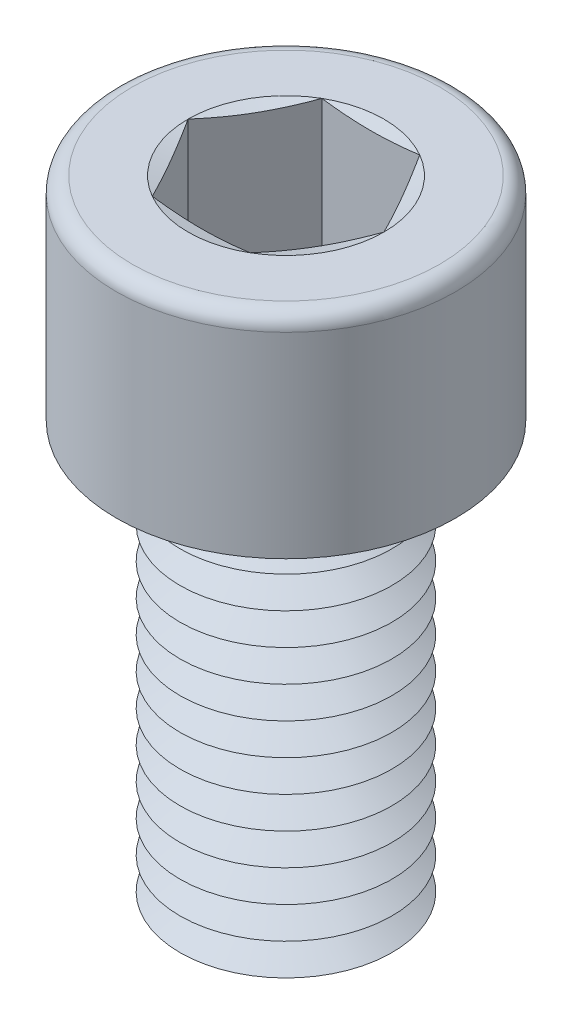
ISO-10303-21;
HEADER;
FILE_DESCRIPTION(('STEP AP214'),'2;1');
FILE_NAME('part.step','',(''),(''),'','','');
FILE_SCHEMA(('AUTOMOTIVE_DESIGN { 1 0 10303 214 1 1 1 1 }'));
ENDSEC;
DATA;
#1=APPLICATION_CONTEXT('core data for automotive mechanical design processes');
#2=APPLICATION_PROTOCOL_DEFINITION('international standard','automotive_design',2000,#1);
#3=PRODUCT_CONTEXT('',#1,'mechanical');
#4=PRODUCT('Part','Part','',(#3));
#5=PRODUCT_RELATED_PRODUCT_CATEGORY('part','',(#4));
#6=PRODUCT_DEFINITION_FORMATION('','',#4);
#7=PRODUCT_DEFINITION_CONTEXT('part definition',#1,'design');
#8=PRODUCT_DEFINITION('design','',#6,#7);
#9=PRODUCT_DEFINITION_SHAPE('','',#8);
#10=(LENGTH_UNIT() NAMED_UNIT(*) SI_UNIT(.MILLI.,.METRE.));
#11=(NAMED_UNIT(*) PLANE_ANGLE_UNIT() SI_UNIT($,.RADIAN.));
#12=(NAMED_UNIT(*) SI_UNIT($,.STERADIAN.) SOLID_ANGLE_UNIT());
#13=UNCERTAINTY_MEASURE_WITH_UNIT(LENGTH_MEASURE(1.E-05),#10,'distance_accuracy_value','');
#14=(GEOMETRIC_REPRESENTATION_CONTEXT(3) GLOBAL_UNCERTAINTY_ASSIGNED_CONTEXT((#13)) GLOBAL_UNIT_ASSIGNED_CONTEXT((#10,
#11,#12)) REPRESENTATION_CONTEXT('',''));
#15=CARTESIAN_POINT('',(0.,0.,0.));
#16=DIRECTION('',(0.,0.,1.));
#17=DIRECTION('',(1.,0.,0.));
#18=AXIS2_PLACEMENT_3D('',#15,#16,#17);
#19=CARTESIAN_POINT('',(0.,6.,0.));
#20=DIRECTION('',(0.,1.,0.));
#21=DIRECTION('',(0.,0.,1.));
#22=AXIS2_PLACEMENT_3D('',#19,#20,#21);
#23=CONICAL_SURFACE('',#22,3.70096189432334,1.0471975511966);
#24=CARTESIAN_POINT('',(0.,6.75,0.));
#25=DIRECTION('',(0.,1.,0.));
#26=DIRECTION('',(0.,0.,1.));
#27=AXIS2_PLACEMENT_3D('',#24,#25,#26);
#28=CIRCLE('',#27,5.);
#29=CARTESIAN_POINT('',(0.,6.75,5.));
#30=VERTEX_POINT('',#29);
#31=EDGE_CURVE('E415',#30,#30,#28,.T.);
#32=ORIENTED_EDGE('',*,*,#31,.F.);
#33=EDGE_LOOP('',(#32));
#34=FACE_BOUND('',#33,.T.);
#35=CARTESIAN_POINT('',(0.,6.,0.));
#36=DIRECTION('',(0.,1.,0.));
#37=DIRECTION('',(0.,0.,1.));
#38=AXIS2_PLACEMENT_3D('',#35,#36,#37);
#39=CIRCLE('',#38,3.70096189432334);
#40=CARTESIAN_POINT('',(0.,6.,3.70096189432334));
#41=VERTEX_POINT('',#40);
#42=EDGE_CURVE('E419',#41,#41,#39,.T.);
#43=ORIENTED_EDGE('',*,*,#42,.T.);
#44=EDGE_LOOP('',(#43));
#45=FACE_BOUND('',#44,.T.);
#46=ADVANCED_FACE('F41',(#34,#45),#23,.T.);
#47=CARTESIAN_POINT('',(0.,5.25,0.));
#48=DIRECTION('',(0.,-1.,0.));
#49=DIRECTION('',(0.,0.,-1.));
#50=AXIS2_PLACEMENT_3D('',#47,#48,#49);
#51=CONICAL_SURFACE('',#50,5.,1.0471975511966);
#52=ORIENTED_EDGE('',*,*,#42,.F.);
#53=EDGE_LOOP('',(#52));
#54=FACE_BOUND('',#53,.T.);
#55=CARTESIAN_POINT('',(0.,5.25,0.));
#56=DIRECTION('',(0.,1.,0.));
#57=DIRECTION('',(0.,0.,1.));
#58=AXIS2_PLACEMENT_3D('',#55,#56,#57);
#59=CIRCLE('',#58,5.);
#60=CARTESIAN_POINT('',(0.,5.25,5.));
#61=VERTEX_POINT('',#60);
#62=EDGE_CURVE('E423',#61,#61,#59,.T.);
#63=ORIENTED_EDGE('',*,*,#62,.T.);
#64=EDGE_LOOP('',(#63));
#65=FACE_BOUND('',#64,.T.);
#66=ADVANCED_FACE('F251',(#54,#65),#51,.T.);
#67=CARTESIAN_POINT('',(0.,0.,0.));
#68=DIRECTION('',(0.,1.,0.));
#69=DIRECTION('',(0.,0.,1.));
#70=AXIS2_PLACEMENT_3D('',#67,#68,#69);
#71=PLANE('',#70);
#72=CARTESIAN_POINT('',(0.,0.,0.));
#73=DIRECTION('',(0.,1.,0.));
#74=DIRECTION('',(0.,0.,1.));
#75=AXIS2_PLACEMENT_3D('',#72,#73,#74);
#76=CIRCLE('',#75,3.70096189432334);
#77=CARTESIAN_POINT('',(0.,0.,3.70096189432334));
#78=VERTEX_POINT('',#77);
#79=EDGE_CURVE('E451',#78,#78,#76,.T.);
#80=ORIENTED_EDGE('',*,*,#79,.F.);
#81=EDGE_LOOP('',(#80));
#82=FACE_BOUND('',#81,.T.);
#83=ADVANCED_FACE('F248',(#82),#71,.F.);
#84=CARTESIAN_POINT('',(0.,0.,0.));
#85=DIRECTION('',(0.,1.,0.));
#86=DIRECTION('',(0.,0.,1.));
#87=AXIS2_PLACEMENT_3D('',#84,#85,#86);
#88=CONICAL_SURFACE('',#87,3.70096189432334,1.0471975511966);
#89=CARTESIAN_POINT('',(0.,0.749999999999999,0.));
#90=DIRECTION('',(0.,1.,0.));
#91=DIRECTION('',(0.,0.,1.));
#92=AXIS2_PLACEMENT_3D('',#89,#90,#91);
#93=CIRCLE('',#92,5.);
#94=CARTESIAN_POINT('',(0.,0.749999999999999,5.));
#95=VERTEX_POINT('',#94);
#96=EDGE_CURVE('E447',#95,#95,#93,.T.);
#97=ORIENTED_EDGE('',*,*,#96,.F.);
#98=EDGE_LOOP('',(#97));
#99=FACE_BOUND('',#98,.T.);
#100=ORIENTED_EDGE('',*,*,#79,.T.);
#101=EDGE_LOOP('',(#100));
#102=FACE_BOUND('',#101,.T.);
#103=ADVANCED_FACE('F250',(#99,#102),#88,.T.);
#104=CARTESIAN_POINT('',(0.,0.749999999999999,0.));
#105=DIRECTION('',(0.,-1.,0.));
#106=DIRECTION('',(0.,0.,-1.));
#107=AXIS2_PLACEMENT_3D('',#104,#105,#106);
#108=CONICAL_SURFACE('',#107,5.,1.0471975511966);
#109=CARTESIAN_POINT('',(0.,1.5,0.));
#110=DIRECTION('',(0.,1.,0.));
#111=DIRECTION('',(0.,0.,1.));
#112=AXIS2_PLACEMENT_3D('',#109,#110,#111);
#113=CIRCLE('',#112,3.70096189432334);
#114=CARTESIAN_POINT('',(0.,1.5,3.70096189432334));
#115=VERTEX_POINT('',#114);
#116=EDGE_CURVE('E443',#115,#115,#113,.T.);
#117=ORIENTED_EDGE('',*,*,#116,.F.);
#118=EDGE_LOOP('',(#117));
#119=FACE_BOUND('',#118,.T.);
#120=ORIENTED_EDGE('',*,*,#96,.T.);
#121=EDGE_LOOP('',(#120));
#122=FACE_BOUND('',#121,.T.);
#123=ADVANCED_FACE('F291',(#119,#122),#108,.T.);
#124=CARTESIAN_POINT('',(0.,1.5,0.));
#125=DIRECTION('',(0.,1.,0.));
#126=DIRECTION('',(0.,0.,1.));
#127=AXIS2_PLACEMENT_3D('',#124,#125,#126);
#128=CONICAL_SURFACE('',#127,3.70096189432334,1.0471975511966);
#129=CARTESIAN_POINT('',(0.,2.25,0.));
#130=DIRECTION('',(0.,1.,0.));
#131=DIRECTION('',(0.,0.,1.));
#132=AXIS2_PLACEMENT_3D('',#129,#130,#131);
#133=CIRCLE('',#132,5.);
#134=CARTESIAN_POINT('',(0.,2.25,5.));
#135=VERTEX_POINT('',#134);
#136=EDGE_CURVE('E439',#135,#135,#133,.T.);
#137=ORIENTED_EDGE('',*,*,#136,.F.);
#138=EDGE_LOOP('',(#137));
#139=FACE_BOUND('',#138,.T.);
#140=ORIENTED_EDGE('',*,*,#116,.T.);
#141=EDGE_LOOP('',(#140));
#142=FACE_BOUND('',#141,.T.);
#143=ADVANCED_FACE('F286',(#139,#142),#128,.T.);
#144=CARTESIAN_POINT('',(0.,2.25,0.));
#145=DIRECTION('',(0.,-1.,0.));
#146=DIRECTION('',(0.,0.,-1.));
#147=AXIS2_PLACEMENT_3D('',#144,#145,#146);
#148=CONICAL_SURFACE('',#147,5.,1.0471975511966);
#149=CARTESIAN_POINT('',(0.,3.,0.));
#150=DIRECTION('',(0.,1.,0.));
#151=DIRECTION('',(0.,0.,1.));
#152=AXIS2_PLACEMENT_3D('',#149,#150,#151);
#153=CIRCLE('',#152,3.70096189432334);
#154=CARTESIAN_POINT('',(0.,3.,3.70096189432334));
#155=VERTEX_POINT('',#154);
#156=EDGE_CURVE('E435',#155,#155,#153,.T.);
#157=ORIENTED_EDGE('',*,*,#156,.F.);
#158=EDGE_LOOP('',(#157));
#159=FACE_BOUND('',#158,.T.);
#160=ORIENTED_EDGE('',*,*,#136,.T.);
#161=EDGE_LOOP('',(#160));
#162=FACE_BOUND('',#161,.T.);
#163=ADVANCED_FACE('F283',(#159,#162),#148,.T.);
#164=CARTESIAN_POINT('',(0.,3.,0.));
#165=DIRECTION('',(0.,1.,0.));
#166=DIRECTION('',(0.,0.,1.));
#167=AXIS2_PLACEMENT_3D('',#164,#165,#166);
#168=CONICAL_SURFACE('',#167,3.70096189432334,1.0471975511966);
#169=CARTESIAN_POINT('',(0.,3.75,0.));
#170=DIRECTION('',(0.,1.,0.));
#171=DIRECTION('',(0.,0.,1.));
#172=AXIS2_PLACEMENT_3D('',#169,#170,#171);
#173=CIRCLE('',#172,5.);
#174=CARTESIAN_POINT('',(0.,3.75,5.));
#175=VERTEX_POINT('',#174);
#176=EDGE_CURVE('E431',#175,#175,#173,.T.);
#177=ORIENTED_EDGE('',*,*,#176,.F.);
#178=EDGE_LOOP('',(#177));
#179=FACE_BOUND('',#178,.T.);
#180=ORIENTED_EDGE('',*,*,#156,.T.);
#181=EDGE_LOOP('',(#180));
#182=FACE_BOUND('',#181,.T.);
#183=ADVANCED_FACE('F277',(#179,#182),#168,.T.);
#184=CARTESIAN_POINT('',(0.,3.75,0.));
#185=DIRECTION('',(0.,-1.,0.));
#186=DIRECTION('',(0.,0.,-1.));
#187=AXIS2_PLACEMENT_3D('',#184,#185,#186);
#188=CONICAL_SURFACE('',#187,5.,1.0471975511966);
#189=CARTESIAN_POINT('',(0.,4.5,0.));
#190=DIRECTION('',(0.,1.,0.));
#191=DIRECTION('',(0.,0.,1.));
#192=AXIS2_PLACEMENT_3D('',#189,#190,#191);
#193=CIRCLE('',#192,3.70096189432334);
#194=CARTESIAN_POINT('',(0.,4.5,3.70096189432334));
#195=VERTEX_POINT('',#194);
#196=EDGE_CURVE('E427',#195,#195,#193,.T.);
#197=ORIENTED_EDGE('',*,*,#196,.F.);
#198=EDGE_LOOP('',(#197));
#199=FACE_BOUND('',#198,.T.);
#200=ORIENTED_EDGE('',*,*,#176,.T.);
#201=EDGE_LOOP('',(#200));
#202=FACE_BOUND('',#201,.T.);
#203=ADVANCED_FACE('F273',(#199,#202),#188,.T.);
#204=CARTESIAN_POINT('',(0.,4.5,0.));
#205=DIRECTION('',(0.,1.,0.));
#206=DIRECTION('',(0.,0.,1.));
#207=AXIS2_PLACEMENT_3D('',#204,#205,#206);
#208=CONICAL_SURFACE('',#207,3.70096189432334,1.0471975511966);
#209=ORIENTED_EDGE('',*,*,#62,.F.);
#210=EDGE_LOOP('',(#209));
#211=FACE_BOUND('',#210,.T.);
#212=ORIENTED_EDGE('',*,*,#196,.T.);
#213=EDGE_LOOP('',(#212));
#214=FACE_BOUND('',#213,.T.);
#215=ADVANCED_FACE('F276',(#211,#214),#208,.T.);
#216=CARTESIAN_POINT('',(0.,7.5,0.));
#217=DIRECTION('',(0.,1.,0.));
#218=DIRECTION('',(0.,0.,1.));
#219=AXIS2_PLACEMENT_3D('',#216,#217,#218);
#220=CONICAL_SURFACE('',#219,3.70096189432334,1.0471975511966);
#221=CARTESIAN_POINT('',(0.,8.25,0.));
#222=DIRECTION('',(0.,1.,0.));
#223=DIRECTION('',(0.,0.,1.));
#224=AXIS2_PLACEMENT_3D('',#221,#222,#223);
#225=CIRCLE('',#224,5.);
#226=CARTESIAN_POINT('',(0.,8.25,5.));
#227=VERTEX_POINT('',#226);
#228=EDGE_CURVE('E407',#227,#227,#225,.T.);
#229=ORIENTED_EDGE('',*,*,#228,.F.);
#230=EDGE_LOOP('',(#229));
#231=FACE_BOUND('',#230,.T.);
#232=CARTESIAN_POINT('',(0.,7.5,0.));
#233=DIRECTION('',(0.,1.,0.));
#234=DIRECTION('',(0.,0.,1.));
#235=AXIS2_PLACEMENT_3D('',#232,#233,#234);
#236=CIRCLE('',#235,3.70096189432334);
#237=CARTESIAN_POINT('',(0.,7.5,3.70096189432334));
#238=VERTEX_POINT('',#237);
#239=EDGE_CURVE('E411',#238,#238,#236,.T.);
#240=ORIENTED_EDGE('',*,*,#239,.T.);
#241=EDGE_LOOP('',(#240));
#242=FACE_BOUND('',#241,.T.);
#243=ADVANCED_FACE('F281',(#231,#242),#220,.T.);
#244=CARTESIAN_POINT('',(0.,6.75,0.));
#245=DIRECTION('',(0.,-1.,0.));
#246=DIRECTION('',(0.,0.,-1.));
#247=AXIS2_PLACEMENT_3D('',#244,#245,#246);
#248=CONICAL_SURFACE('',#247,5.,1.0471975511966);
#249=ORIENTED_EDGE('',*,*,#239,.F.);
#250=EDGE_LOOP('',(#249));
#251=FACE_BOUND('',#250,.T.);
#252=ORIENTED_EDGE('',*,*,#31,.T.);
#253=EDGE_LOOP('',(#252));
#254=FACE_BOUND('',#253,.T.);
#255=ADVANCED_FACE('F722',(#251,#254),#248,.T.);
#256=CARTESIAN_POINT('',(0.,9.,0.));
#257=DIRECTION('',(0.,1.,0.));
#258=DIRECTION('',(0.,0.,1.));
#259=AXIS2_PLACEMENT_3D('',#256,#257,#258);
#260=CONICAL_SURFACE('',#259,3.70096189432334,1.0471975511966);
#261=CARTESIAN_POINT('',(0.,9.75,0.));
#262=DIRECTION('',(0.,1.,0.));
#263=DIRECTION('',(0.,0.,1.));
#264=AXIS2_PLACEMENT_3D('',#261,#262,#263);
#265=CIRCLE('',#264,5.);
#266=CARTESIAN_POINT('',(0.,9.75,5.));
#267=VERTEX_POINT('',#266);
#268=EDGE_CURVE('E399',#267,#267,#265,.T.);
#269=ORIENTED_EDGE('',*,*,#268,.F.);
#270=EDGE_LOOP('',(#269));
#271=FACE_BOUND('',#270,.T.);
#272=CARTESIAN_POINT('',(0.,9.,0.));
#273=DIRECTION('',(0.,1.,0.));
#274=DIRECTION('',(0.,0.,1.));
#275=AXIS2_PLACEMENT_3D('',#272,#273,#274);
#276=CIRCLE('',#275,3.70096189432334);
#277=CARTESIAN_POINT('',(0.,9.,3.70096189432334));
#278=VERTEX_POINT('',#277);
#279=EDGE_CURVE('E403',#278,#278,#276,.T.);
#280=ORIENTED_EDGE('',*,*,#279,.T.);
#281=EDGE_LOOP('',(#280));
#282=FACE_BOUND('',#281,.T.);
#283=ADVANCED_FACE('F713',(#271,#282),#260,.T.);
#284=CARTESIAN_POINT('',(0.,8.25,0.));
#285=DIRECTION('',(0.,-1.,0.));
#286=DIRECTION('',(0.,0.,-1.));
#287=AXIS2_PLACEMENT_3D('',#284,#285,#286);
#288=CONICAL_SURFACE('',#287,5.,1.0471975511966);
#289=ORIENTED_EDGE('',*,*,#279,.F.);
#290=EDGE_LOOP('',(#289));
#291=FACE_BOUND('',#290,.T.);
#292=ORIENTED_EDGE('',*,*,#228,.T.);
#293=EDGE_LOOP('',(#292));
#294=FACE_BOUND('',#293,.T.);
#295=ADVANCED_FACE('F704',(#291,#294),#288,.T.);
#296=CARTESIAN_POINT('',(0.,10.5,0.));
#297=DIRECTION('',(0.,1.,0.));
#298=DIRECTION('',(0.,0.,1.));
#299=AXIS2_PLACEMENT_3D('',#296,#297,#298);
#300=CONICAL_SURFACE('',#299,3.70096189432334,1.0471975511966);
#301=CARTESIAN_POINT('',(0.,11.25,0.));
#302=DIRECTION('',(0.,1.,0.));
#303=DIRECTION('',(0.,0.,1.));
#304=AXIS2_PLACEMENT_3D('',#301,#302,#303);
#305=CIRCLE('',#304,5.);
#306=CARTESIAN_POINT('',(0.,11.25,5.));
#307=VERTEX_POINT('',#306);
#308=EDGE_CURVE('E391',#307,#307,#305,.T.);
#309=ORIENTED_EDGE('',*,*,#308,.F.);
#310=EDGE_LOOP('',(#309));
#311=FACE_BOUND('',#310,.T.);
#312=CARTESIAN_POINT('',(0.,10.5,0.));
#313=DIRECTION('',(0.,1.,0.));
#314=DIRECTION('',(0.,0.,1.));
#315=AXIS2_PLACEMENT_3D('',#312,#313,#314);
#316=CIRCLE('',#315,3.70096189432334);
#317=CARTESIAN_POINT('',(0.,10.5,3.70096189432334));
#318=VERTEX_POINT('',#317);
#319=EDGE_CURVE('E395',#318,#318,#316,.T.);
#320=ORIENTED_EDGE('',*,*,#319,.T.);
#321=EDGE_LOOP('',(#320));
#322=FACE_BOUND('',#321,.T.);
#323=ADVANCED_FACE('F695',(#311,#322),#300,.T.);
#324=CARTESIAN_POINT('',(0.,9.75,0.));
#325=DIRECTION('',(0.,-1.,0.));
#326=DIRECTION('',(0.,0.,-1.));
#327=AXIS2_PLACEMENT_3D('',#324,#325,#326);
#328=CONICAL_SURFACE('',#327,5.,1.0471975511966);
#329=ORIENTED_EDGE('',*,*,#319,.F.);
#330=EDGE_LOOP('',(#329));
#331=FACE_BOUND('',#330,.T.);
#332=ORIENTED_EDGE('',*,*,#268,.T.);
#333=EDGE_LOOP('',(#332));
#334=FACE_BOUND('',#333,.T.);
#335=ADVANCED_FACE('F686',(#331,#334),#328,.T.);
#336=CARTESIAN_POINT('',(0.,12.,0.));
#337=DIRECTION('',(0.,1.,0.));
#338=DIRECTION('',(0.,0.,1.));
#339=AXIS2_PLACEMENT_3D('',#336,#337,#338);
#340=CONICAL_SURFACE('',#339,3.70096189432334,1.0471975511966);
#341=CARTESIAN_POINT('',(0.,12.75,0.));
#342=DIRECTION('',(0.,1.,0.));
#343=DIRECTION('',(0.,0.,1.));
#344=AXIS2_PLACEMENT_3D('',#341,#342,#343);
#345=CIRCLE('',#344,5.);
#346=CARTESIAN_POINT('',(0.,12.75,5.));
#347=VERTEX_POINT('',#346);
#348=EDGE_CURVE('E383',#347,#347,#345,.T.);
#349=ORIENTED_EDGE('',*,*,#348,.F.);
#350=EDGE_LOOP('',(#349));
#351=FACE_BOUND('',#350,.T.);
#352=CARTESIAN_POINT('',(0.,12.,0.));
#353=DIRECTION('',(0.,1.,0.));
#354=DIRECTION('',(0.,0.,1.));
#355=AXIS2_PLACEMENT_3D('',#352,#353,#354);
#356=CIRCLE('',#355,3.70096189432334);
#357=CARTESIAN_POINT('',(0.,12.,3.70096189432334));
#358=VERTEX_POINT('',#357);
#359=EDGE_CURVE('E387',#358,#358,#356,.T.);
#360=ORIENTED_EDGE('',*,*,#359,.T.);
#361=EDGE_LOOP('',(#360));
#362=FACE_BOUND('',#361,.T.);
#363=ADVANCED_FACE('F677',(#351,#362),#340,.T.);
#364=CARTESIAN_POINT('',(0.,11.25,0.));
#365=DIRECTION('',(0.,-1.,0.));
#366=DIRECTION('',(0.,0.,-1.));
#367=AXIS2_PLACEMENT_3D('',#364,#365,#366);
#368=CONICAL_SURFACE('',#367,5.,1.0471975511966);
#369=ORIENTED_EDGE('',*,*,#359,.F.);
#370=EDGE_LOOP('',(#369));
#371=FACE_BOUND('',#370,.T.);
#372=ORIENTED_EDGE('',*,*,#308,.T.);
#373=EDGE_LOOP('',(#372));
#374=FACE_BOUND('',#373,.T.);
#375=ADVANCED_FACE('F668',(#371,#374),#368,.T.);
#376=CARTESIAN_POINT('',(0.,13.5,0.));
#377=DIRECTION('',(0.,1.,0.));
#378=DIRECTION('',(0.,0.,1.));
#379=AXIS2_PLACEMENT_3D('',#376,#377,#378);
#380=CONICAL_SURFACE('',#379,3.70096189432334,1.0471975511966);
#381=CARTESIAN_POINT('',(0.,14.25,0.));
#382=DIRECTION('',(0.,1.,0.));
#383=DIRECTION('',(0.,0.,1.));
#384=AXIS2_PLACEMENT_3D('',#381,#382,#383);
#385=CIRCLE('',#384,5.);
#386=CARTESIAN_POINT('',(0.,14.25,5.));
#387=VERTEX_POINT('',#386);
#388=EDGE_CURVE('E375',#387,#387,#385,.T.);
#389=ORIENTED_EDGE('',*,*,#388,.F.);
#390=EDGE_LOOP('',(#389));
#391=FACE_BOUND('',#390,.T.);
#392=CARTESIAN_POINT('',(0.,13.5,0.));
#393=DIRECTION('',(0.,1.,0.));
#394=DIRECTION('',(0.,0.,1.));
#395=AXIS2_PLACEMENT_3D('',#392,#393,#394);
#396=CIRCLE('',#395,3.70096189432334);
#397=CARTESIAN_POINT('',(0.,13.5,3.70096189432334));
#398=VERTEX_POINT('',#397);
#399=EDGE_CURVE('E379',#398,#398,#396,.T.);
#400=ORIENTED_EDGE('',*,*,#399,.T.);
#401=EDGE_LOOP('',(#400));
#402=FACE_BOUND('',#401,.T.);
#403=ADVANCED_FACE('F659',(#391,#402),#380,.T.);
#404=CARTESIAN_POINT('',(0.,12.75,0.));
#405=DIRECTION('',(0.,-1.,0.));
#406=DIRECTION('',(0.,0.,-1.));
#407=AXIS2_PLACEMENT_3D('',#404,#405,#406);
#408=CONICAL_SURFACE('',#407,5.,1.0471975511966);
#409=ORIENTED_EDGE('',*,*,#399,.F.);
#410=EDGE_LOOP('',(#409));
#411=FACE_BOUND('',#410,.T.);
#412=ORIENTED_EDGE('',*,*,#348,.T.);
#413=EDGE_LOOP('',(#412));
#414=FACE_BOUND('',#413,.T.);
#415=ADVANCED_FACE('F650',(#411,#414),#408,.T.);
#416=CARTESIAN_POINT('',(0.,15.,0.));
#417=DIRECTION('',(0.,1.,0.));
#418=DIRECTION('',(0.,0.,1.));
#419=AXIS2_PLACEMENT_3D('',#416,#417,#418);
#420=CONICAL_SURFACE('',#419,3.70096189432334,1.0471975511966);
#421=CARTESIAN_POINT('',(0.,15.75,0.));
#422=DIRECTION('',(0.,1.,0.));
#423=DIRECTION('',(0.,0.,1.));
#424=AXIS2_PLACEMENT_3D('',#421,#422,#423);
#425=CIRCLE('',#424,5.);
#426=CARTESIAN_POINT('',(0.,15.75,5.));
#427=VERTEX_POINT('',#426);
#428=EDGE_CURVE('E367',#427,#427,#425,.T.);
#429=ORIENTED_EDGE('',*,*,#428,.F.);
#430=EDGE_LOOP('',(#429));
#431=FACE_BOUND('',#430,.T.);
#432=CARTESIAN_POINT('',(0.,15.,0.));
#433=DIRECTION('',(0.,1.,0.));
#434=DIRECTION('',(0.,0.,1.));
#435=AXIS2_PLACEMENT_3D('',#432,#433,#434);
#436=CIRCLE('',#435,3.70096189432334);
#437=CARTESIAN_POINT('',(0.,15.,3.70096189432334));
#438=VERTEX_POINT('',#437);
#439=EDGE_CURVE('E371',#438,#438,#436,.T.);
#440=ORIENTED_EDGE('',*,*,#439,.T.);
#441=EDGE_LOOP('',(#440));
#442=FACE_BOUND('',#441,.T.);
#443=ADVANCED_FACE('F641',(#431,#442),#420,.T.);
#444=CARTESIAN_POINT('',(0.,14.25,0.));
#445=DIRECTION('',(0.,-1.,0.));
#446=DIRECTION('',(0.,0.,-1.));
#447=AXIS2_PLACEMENT_3D('',#444,#445,#446);
#448=CONICAL_SURFACE('',#447,5.,1.0471975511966);
#449=ORIENTED_EDGE('',*,*,#439,.F.);
#450=EDGE_LOOP('',(#449));
#451=FACE_BOUND('',#450,.T.);
#452=ORIENTED_EDGE('',*,*,#388,.T.);
#453=EDGE_LOOP('',(#452));
#454=FACE_BOUND('',#453,.T.);
#455=ADVANCED_FACE('F632',(#451,#454),#448,.T.);
#456=CARTESIAN_POINT('',(0.,16.5,0.));
#457=DIRECTION('',(0.,1.,0.));
#458=DIRECTION('',(0.,0.,1.));
#459=AXIS2_PLACEMENT_3D('',#456,#457,#458);
#460=CONICAL_SURFACE('',#459,3.70096189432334,1.0471975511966);
#461=CARTESIAN_POINT('',(0.,17.25,0.));
#462=DIRECTION('',(0.,1.,0.));
#463=DIRECTION('',(0.,0.,1.));
#464=AXIS2_PLACEMENT_3D('',#461,#462,#463);
#465=CIRCLE('',#464,5.);
#466=CARTESIAN_POINT('',(0.,17.25,5.));
#467=VERTEX_POINT('',#466);
#468=EDGE_CURVE('E352',#467,#467,#465,.T.);
#469=ORIENTED_EDGE('',*,*,#468,.F.);
#470=EDGE_LOOP('',(#469));
#471=FACE_BOUND('',#470,.T.);
#472=CARTESIAN_POINT('',(0.,16.5,0.));
#473=DIRECTION('',(0.,1.,0.));
#474=DIRECTION('',(0.,0.,1.));
#475=AXIS2_PLACEMENT_3D('',#472,#473,#474);
#476=CIRCLE('',#475,3.70096189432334);
#477=CARTESIAN_POINT('',(0.,16.5,3.70096189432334));
#478=VERTEX_POINT('',#477);
#479=EDGE_CURVE('E363',#478,#478,#476,.T.);
#480=ORIENTED_EDGE('',*,*,#479,.T.);
#481=EDGE_LOOP('',(#480));
#482=FACE_BOUND('',#481,.T.);
#483=ADVANCED_FACE('F623',(#471,#482),#460,.T.);
#484=CARTESIAN_POINT('',(0.,15.75,0.));
#485=DIRECTION('',(0.,-1.,0.));
#486=DIRECTION('',(0.,0.,-1.));
#487=AXIS2_PLACEMENT_3D('',#484,#485,#486);
#488=CONICAL_SURFACE('',#487,5.,1.0471975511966);
#489=ORIENTED_EDGE('',*,*,#479,.F.);
#490=EDGE_LOOP('',(#489));
#491=FACE_BOUND('',#490,.T.);
#492=ORIENTED_EDGE('',*,*,#428,.T.);
#493=EDGE_LOOP('',(#492));
#494=FACE_BOUND('',#493,.T.);
#495=ADVANCED_FACE('F615',(#491,#494),#488,.T.);
#496=CARTESIAN_POINT('',(0.,18.,0.));
#497=DIRECTION('',(0.,1.,0.));
#498=DIRECTION('',(0.,0.,1.));
#499=AXIS2_PLACEMENT_3D('',#496,#497,#498);
#500=CONICAL_SURFACE('',#499,3.70096189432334,1.0471975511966);
#501=CARTESIAN_POINT('',(0.,18.75,0.));
#502=DIRECTION('',(0.,1.,0.));
#503=DIRECTION('',(0.,0.,1.));
#504=AXIS2_PLACEMENT_3D('',#501,#502,#503);
#505=CIRCLE('',#504,5.);
#506=CARTESIAN_POINT('',(0.,18.75,5.));
#507=VERTEX_POINT('',#506);
#508=EDGE_CURVE('E358',#507,#507,#505,.T.);
#509=ORIENTED_EDGE('',*,*,#508,.F.);
#510=EDGE_LOOP('',(#509));
#511=FACE_BOUND('',#510,.T.);
#512=CARTESIAN_POINT('',(0.,18.,0.));
#513=DIRECTION('',(0.,1.,0.));
#514=DIRECTION('',(0.,0.,1.));
#515=AXIS2_PLACEMENT_3D('',#512,#513,#514);
#516=CIRCLE('',#515,3.70096189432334);
#517=CARTESIAN_POINT('',(0.,18.,3.70096189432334));
#518=VERTEX_POINT('',#517);
#519=EDGE_CURVE('E348',#518,#518,#516,.T.);
#520=ORIENTED_EDGE('',*,*,#519,.T.);
#521=EDGE_LOOP('',(#520));
#522=FACE_BOUND('',#521,.T.);
#523=ADVANCED_FACE('F607',(#511,#522),#500,.T.);
#524=CARTESIAN_POINT('',(0.,17.25,0.));
#525=DIRECTION('',(0.,-1.,0.));
#526=DIRECTION('',(0.,0.,-1.));
#527=AXIS2_PLACEMENT_3D('',#524,#525,#526);
#528=CONICAL_SURFACE('',#527,5.,1.0471975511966);
#529=ORIENTED_EDGE('',*,*,#519,.F.);
#530=EDGE_LOOP('',(#529));
#531=FACE_BOUND('',#530,.T.);
#532=ORIENTED_EDGE('',*,*,#468,.T.);
#533=EDGE_LOOP('',(#532));
#534=FACE_BOUND('',#533,.T.);
#535=ADVANCED_FACE('F195',(#531,#534),#528,.T.);
#536=CARTESIAN_POINT('',(0.,30.,0.));
#537=DIRECTION('',(0.,1.,0.));
#538=DIRECTION('',(0.,0.,1.));
#539=AXIS2_PLACEMENT_3D('',#536,#537,#538);
#540=PLANE('',#539);
#541=CARTESIAN_POINT('',(0.,30.,0.));
#542=DIRECTION('',(0.,1.,0.));
#543=DIRECTION('',(0.,0.,1.));
#544=AXIS2_PLACEMENT_3D('',#541,#542,#543);
#545=CIRCLE('',#544,4.61880215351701);
#546=CARTESIAN_POINT('',(2.3094010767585,30.,4.));
#547=VERTEX_POINT('',#546);
#548=CARTESIAN_POINT('',(4.61880215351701,30.,0.));
#549=VERTEX_POINT('',#548);
#550=EDGE_CURVE('E121',#547,#549,#545,.T.);
#551=ORIENTED_EDGE('',*,*,#550,.F.);
#552=CARTESIAN_POINT('',(0.,30.,0.));
#553=DIRECTION('',(0.,1.,0.));
#554=DIRECTION('',(0.,0.,1.));
#555=AXIS2_PLACEMENT_3D('',#552,#553,#554);
#556=CIRCLE('',#555,4.61880215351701);
#557=CARTESIAN_POINT('',(-2.3094010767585,30.,4.));
#558=VERTEX_POINT('',#557);
#559=EDGE_CURVE('E45',#558,#547,#556,.T.);
#560=ORIENTED_EDGE('',*,*,#559,.F.);
#561=CARTESIAN_POINT('',(-4.61880215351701,30.,0.));
#562=VERTEX_POINT('',#561);
#563=EDGE_CURVE('E138',#562,#558,#556,.T.);
#564=ORIENTED_EDGE('',*,*,#563,.F.);
#565=CARTESIAN_POINT('',(-2.3094010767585,30.,-4.));
#566=VERTEX_POINT('',#565);
#567=EDGE_CURVE('E982',#566,#562,#556,.T.);
#568=ORIENTED_EDGE('',*,*,#567,.F.);
#569=CARTESIAN_POINT('',(2.3094010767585,30.,-4.));
#570=VERTEX_POINT('',#569);
#571=EDGE_CURVE('E51',#570,#566,#556,.T.);
#572=ORIENTED_EDGE('',*,*,#571,.F.);
#573=EDGE_CURVE('E11',#549,#570,#556,.T.);
#574=ORIENTED_EDGE('',*,*,#573,.F.);
#575=EDGE_LOOP('',(#551,#560,#564,#568,#572,#574));
#576=FACE_BOUND('',#575,.T.);
#577=CARTESIAN_POINT('',(0.,30.,0.));
#578=DIRECTION('',(0.,1.,0.));
#579=DIRECTION('',(0.,0.,1.));
#580=AXIS2_PLACEMENT_3D('',#577,#578,#579);
#581=CIRCLE('',#580,7.25);
#582=CARTESIAN_POINT('',(0.,30.,7.25));
#583=VERTEX_POINT('',#582);
#584=EDGE_CURVE('E496',#583,#583,#581,.T.);
#585=ORIENTED_EDGE('',*,*,#584,.T.);
#586=EDGE_LOOP('',(#585));
#587=FACE_BOUND('',#586,.T.);
#588=ADVANCED_FACE('F140',(#576,#587),#540,.T.);
#589=CARTESIAN_POINT('',(0.,29.25,0.));
#590=DIRECTION('',(0.,1.,0.));
#591=DIRECTION('',(0.,0.,1.));
#592=AXIS2_PLACEMENT_3D('',#589,#590,#591);
#593=TOROIDAL_SURFACE('',#592,7.25,0.75);
#594=CARTESIAN_POINT('',(0.,29.25,0.));
#595=DIRECTION('',(0.,1.,0.));
#596=DIRECTION('',(0.,0.,1.));
#597=AXIS2_PLACEMENT_3D('',#594,#595,#596);
#598=CIRCLE('',#597,8.);
#599=CARTESIAN_POINT('',(0.,29.25,8.));
#600=VERTEX_POINT('',#599);
#601=EDGE_CURVE('E500',#600,#600,#598,.F.);
#602=ORIENTED_EDGE('',*,*,#601,.F.);
#603=EDGE_LOOP('',(#602));
#604=FACE_BOUND('',#603,.T.);
#605=ORIENTED_EDGE('',*,*,#584,.F.);
#606=EDGE_LOOP('',(#605));
#607=FACE_BOUND('',#606,.T.);
#608=ADVANCED_FACE('F43',(#604,#607),#593,.T.);
#609=CARTESIAN_POINT('',(0.,30.,0.));
#610=DIRECTION('',(0.,-1.,0.));
#611=DIRECTION('',(0.,0.,-1.));
#612=AXIS2_PLACEMENT_3D('',#609,#610,#611);
#613=CYLINDRICAL_SURFACE('',#612,8.);
#614=ORIENTED_EDGE('',*,*,#601,.T.);
#615=EDGE_LOOP('',(#614));
#616=FACE_BOUND('',#615,.T.);
#617=CARTESIAN_POINT('',(0.,20.,0.));
#618=DIRECTION('',(0.,1.,0.));
#619=DIRECTION('',(0.,0.,1.));
#620=AXIS2_PLACEMENT_3D('',#617,#618,#619);
#621=CIRCLE('',#620,8.);
#622=CARTESIAN_POINT('',(0.,20.,8.));
#623=VERTEX_POINT('',#622);
#624=EDGE_CURVE('E483',#623,#623,#621,.T.);
#625=ORIENTED_EDGE('',*,*,#624,.T.);
#626=EDGE_LOOP('',(#625));
#627=FACE_BOUND('',#626,.T.);
#628=ADVANCED_FACE('F243',(#616,#627),#613,.T.);
#629=CARTESIAN_POINT('',(0.,20.,0.));
#630=DIRECTION('',(0.,1.,0.));
#631=DIRECTION('',(0.,0.,1.));
#632=AXIS2_PLACEMENT_3D('',#629,#630,#631);
#633=PLANE('',#632);
#634=ORIENTED_EDGE('',*,*,#624,.F.);
#635=EDGE_LOOP('',(#634));
#636=FACE_BOUND('',#635,.T.);
#637=CARTESIAN_POINT('',(0.,20.,0.));
#638=DIRECTION('',(0.,1.,0.));
#639=DIRECTION('',(0.,0.,1.));
#640=AXIS2_PLACEMENT_3D('',#637,#638,#639);
#641=CIRCLE('',#640,5.);
#642=CARTESIAN_POINT('',(0.,20.,5.));
#643=VERTEX_POINT('',#642);
#644=EDGE_CURVE('E492',#643,#643,#641,.T.);
#645=ORIENTED_EDGE('',*,*,#644,.T.);
#646=EDGE_LOOP('',(#645));
#647=FACE_BOUND('',#646,.T.);
#648=ADVANCED_FACE('F239',(#636,#647),#633,.F.);
#649=CARTESIAN_POINT('',(0.,20.,0.));
#650=DIRECTION('',(0.,-1.,0.));
#651=DIRECTION('',(0.,0.,-1.));
#652=AXIS2_PLACEMENT_3D('',#649,#650,#651);
#653=CYLINDRICAL_SURFACE('',#652,5.);
#654=ORIENTED_EDGE('',*,*,#508,.T.);
#655=EDGE_LOOP('',(#654));
#656=FACE_BOUND('',#655,.T.);
#657=ORIENTED_EDGE('',*,*,#644,.F.);
#658=EDGE_LOOP('',(#657));
#659=FACE_BOUND('',#658,.T.);
#660=ADVANCED_FACE('F242',(#656,#659),#653,.T.);
#661=CARTESIAN_POINT('',(0.,30.,0.));
#662=DIRECTION('',(0.,1.,0.));
#663=DIRECTION('',(0.,0.,1.));
#664=AXIS2_PLACEMENT_3D('',#661,#662,#663);
#665=CONICAL_SURFACE('',#664,4.61880215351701,1.30899693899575);
#666=ORIENTED_EDGE('',*,*,#559,.T.);
#667=CARTESIAN_POINT('',(-6.02881516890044,30.7010337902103,4.));
#668=CARTESIAN_POINT('',(-5.8481958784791,30.6607170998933,4.));
#669=CARTESIAN_POINT('',(-5.66746141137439,30.6209072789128,4.));
#670=CARTESIAN_POINT('',(-5.30570552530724,30.5425748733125,4.));
#671=CARTESIAN_POINT('',(-5.12468409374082,30.5040523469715,4.));
#672=CARTESIAN_POINT('',(-4.76212658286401,30.4285326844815,4.));
#673=CARTESIAN_POINT('',(-4.58059016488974,30.3915371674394,4.));
#674=CARTESIAN_POINT('',(-4.21713405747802,30.3194839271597,4.));
#675=CARTESIAN_POINT('',(-4.03521437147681,30.2844261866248,4.));
#676=CARTESIAN_POINT('',(-3.67250657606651,30.217001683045,4.));
#677=CARTESIAN_POINT('',(-3.49172236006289,30.1846141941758,4.));
#678=CARTESIAN_POINT('',(-3.12965653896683,30.1227577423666,4.));
#679=CARTESIAN_POINT('',(-2.94837492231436,30.093288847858,4.));
#680=CARTESIAN_POINT('',(-2.40374454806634,30.0102645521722,4.));
#681=CARTESIAN_POINT('',(-2.03952090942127,29.9620742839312,4.));
#682=CARTESIAN_POINT('',(-1.48950033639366,29.905182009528,4.));
#683=CARTESIAN_POINT('',(-1.30450135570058,29.8887355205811,4.));
#684=CARTESIAN_POINT('',(-0.93405305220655,29.861988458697,4.));
#685=CARTESIAN_POINT('',(-0.748603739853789,29.8516877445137,4.));
#686=CARTESIAN_POINT('',(-0.37752889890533,29.8378309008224,4.));
#687=CARTESIAN_POINT('',(-0.191903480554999,29.834271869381,4.));
#688=CARTESIAN_POINT('',(0.179350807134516,29.8341156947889,4.));
#689=CARTESIAN_POINT('',(0.364979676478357,29.8375185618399,4.));
#690=CARTESIAN_POINT('',(0.736742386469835,29.8510980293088,4.));
#691=CARTESIAN_POINT('',(0.922875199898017,29.8613021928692,4.));
#692=CARTESIAN_POINT('',(1.29469888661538,29.8879135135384,4.));
#693=CARTESIAN_POINT('',(1.48038973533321,29.9043210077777,4.));
#694=CARTESIAN_POINT('',(1.85132520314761,29.942529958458,4.));
#695=CARTESIAN_POINT('',(2.036569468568,29.9643347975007,4.));
#696=CARTESIAN_POINT('',(2.40646407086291,30.0124559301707,4.));
#697=CARTESIAN_POINT('',(2.59111440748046,30.0387722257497,4.));
#698=CARTESIAN_POINT('',(2.96467049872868,30.0958323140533,4.));
#699=CARTESIAN_POINT('',(3.15356118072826,30.1266739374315,4.));
#700=CARTESIAN_POINT('',(3.53080577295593,30.1914895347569,4.));
#701=CARTESIAN_POINT('',(3.71915966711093,30.225463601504,4.));
#702=CARTESIAN_POINT('',(4.2835627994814,30.331122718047,4.));
#703=CARTESIAN_POINT('',(4.65891157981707,30.4065379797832,4.));
#704=CARTESIAN_POINT('',(5.40835351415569,30.5637698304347,4.));
#705=CARTESIAN_POINT('',(5.78244627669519,30.6455882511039,4.));
#706=CARTESIAN_POINT('',(6.52968076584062,30.8134827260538,4.));
#707=CARTESIAN_POINT('',(6.90282246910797,30.8995588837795,4.));
#708=CARTESIAN_POINT('',(7.64386653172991,31.0735615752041,4.));
#709=CARTESIAN_POINT('',(8.01177724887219,31.1614526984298,4.));
#710=CARTESIAN_POINT('',(8.74711499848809,31.3392675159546,4.));
#711=CARTESIAN_POINT('',(9.11454201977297,31.4291912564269,4.));
#712=CARTESIAN_POINT('',(9.84851788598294,31.6103931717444,4.));
#713=CARTESIAN_POINT('',(10.2150672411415,31.7016692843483,4.));
#714=CARTESIAN_POINT('',(10.9478692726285,31.8853497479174,4.));
#715=CARTESIAN_POINT('',(11.3141219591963,31.977754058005,4.));
#716=CARTESIAN_POINT('',(11.6802738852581,32.0705515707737,4.));
#717=B_SPLINE_CURVE_WITH_KNOTS('',3,(#667,#668,#669,#670,#671,#672,#673,#674,#675,#676,#677,
#678,#679,#680,#681,#682,#683,#684,#685,#686,#687,#688,#689,#690,#691,#692,#693,#694,#695,#696,
#697,#698,#699,#700,#701,#702,#703,#704,#705,#706,#707,#708,#709,#710,#711,#712,#713,#714,#715,
#716),.UNSPECIFIED.,.F.,.F.,(4,2,2,2,2,2,2,2,2,2,2,2,2,2,2,2,2,2,2,2,2,2,2,2,4),(0.,
0.555194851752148,1.11041480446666,1.66620908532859,2.22199840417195,2.77296094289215,
3.32393639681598,4.42561440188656,4.98271716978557,5.5398071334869,6.09665724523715,
6.65350817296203,7.21262964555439,7.77178150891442,8.33128469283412,8.89078811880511,
9.46493123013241,10.0390913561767,11.1875388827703,12.3363161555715,13.4851213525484,
14.6199040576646,15.7547125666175,16.8879395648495,18.0211256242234),.UNSPECIFIED.);
#718=EDGE_CURVE('E127',#558,#547,#717,.T.);
#719=ORIENTED_EDGE('',*,*,#718,.F.);
#720=EDGE_LOOP('',(#666,#719));
#721=FACE_BOUND('',#720,.T.);
#722=ADVANCED_FACE('F132',(#721),#665,.F.);
#723=ORIENTED_EDGE('',*,*,#563,.T.);
#724=CARTESIAN_POINT('',(-4.61891762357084,30.0000309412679,-0.000199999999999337));
#725=CARTESIAN_POINT('',(-4.52300443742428,29.9743194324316,0.165926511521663));
#726=CARTESIAN_POINT('',(-4.42691734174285,29.9509775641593,0.332354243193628));
#727=CARTESIAN_POINT('',(-4.23440378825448,29.9099680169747,0.66579749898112));
#728=CARTESIAN_POINT('',(-4.13797720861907,29.8923026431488,0.832813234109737));
#729=CARTESIAN_POINT('',(-3.94536936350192,29.8636774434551,1.16641980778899));
#730=CARTESIAN_POINT('',(-3.84918940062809,29.8526834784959,1.33300839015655));
#731=CARTESIAN_POINT('',(-3.65670681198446,29.8379416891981,1.66639801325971));
#732=CARTESIAN_POINT('',(-3.5604042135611,29.8341924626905,1.83319900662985));
#733=CARTESIAN_POINT('',(-3.3677990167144,29.8341924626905,2.16680099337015));
#734=CARTESIAN_POINT('',(-3.27149641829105,29.8379416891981,2.33360198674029));
#735=CARTESIAN_POINT('',(-3.07901382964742,29.8526834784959,2.66699160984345));
#736=CARTESIAN_POINT('',(-2.98283386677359,29.8636774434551,2.83358019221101));
#737=CARTESIAN_POINT('',(-2.79022602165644,29.8923026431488,3.16718676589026));
#738=CARTESIAN_POINT('',(-2.69379944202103,29.9099680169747,3.33420250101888));
#739=CARTESIAN_POINT('',(-2.50128588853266,29.9509775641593,3.66764575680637));
#740=CARTESIAN_POINT('',(-2.40519879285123,29.9743194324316,3.83407348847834));
#741=CARTESIAN_POINT('',(-2.30928560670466,30.0000309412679,4.0002));
#742=B_SPLINE_CURVE_WITH_KNOTS('',3,(#724,#725,#726,#727,#728,#729,#730,#731,#732,#733,#734,
#735,#736,#737,#738,#739,#740,#741),.UNSPECIFIED.,.F.,.F.,(4,2,2,2,2,2,2,2,4),(0.,
0.580655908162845,1.1615473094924,1.73944052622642,2.31722188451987,2.89500324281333,
3.47289645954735,4.0537878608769,4.63444376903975),.UNSPECIFIED.);
#743=EDGE_CURVE('E163',#562,#558,#742,.T.);
#744=ORIENTED_EDGE('',*,*,#743,.F.);
#745=EDGE_LOOP('',(#723,#744));
#746=FACE_BOUND('',#745,.T.);
#747=ADVANCED_FACE('F258',(#746),#665,.F.);
#748=ORIENTED_EDGE('',*,*,#567,.T.);
#749=CARTESIAN_POINT('',(-2.30928560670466,30.0000309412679,-4.0002));
#750=CARTESIAN_POINT('',(-2.40519879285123,29.9743194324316,-3.83407348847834));
#751=CARTESIAN_POINT('',(-2.50128588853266,29.9509775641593,-3.66764575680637));
#752=CARTESIAN_POINT('',(-2.69379944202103,29.9099680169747,-3.33420250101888));
#753=CARTESIAN_POINT('',(-2.79022602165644,29.8923026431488,-3.16718676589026));
#754=CARTESIAN_POINT('',(-2.98283386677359,29.8636774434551,-2.83358019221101));
#755=CARTESIAN_POINT('',(-3.07901382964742,29.8526834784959,-2.66699160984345));
#756=CARTESIAN_POINT('',(-3.27149641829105,29.8379416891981,-2.33360198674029));
#757=CARTESIAN_POINT('',(-3.3677990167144,29.8341924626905,-2.16680099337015));
#758=CARTESIAN_POINT('',(-3.5604042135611,29.8341924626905,-1.83319900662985));
#759=CARTESIAN_POINT('',(-3.65670681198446,29.8379416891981,-1.66639801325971));
#760=CARTESIAN_POINT('',(-3.84918940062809,29.8526834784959,-1.33300839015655));
#761=CARTESIAN_POINT('',(-3.94536936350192,29.8636774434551,-1.16641980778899));
#762=CARTESIAN_POINT('',(-4.13797720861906,29.8923026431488,-0.832813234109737));
#763=CARTESIAN_POINT('',(-4.23440378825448,29.9099680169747,-0.66579749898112));
#764=CARTESIAN_POINT('',(-4.42691734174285,29.9509775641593,-0.332354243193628));
#765=CARTESIAN_POINT('',(-4.52300443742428,29.9743194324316,-0.165926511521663));
#766=CARTESIAN_POINT('',(-4.61891762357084,30.0000309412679,0.000199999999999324));
#767=B_SPLINE_CURVE_WITH_KNOTS('',3,(#749,#750,#751,#752,#753,#754,#755,#756,#757,#758,#759,
#760,#761,#762,#763,#764,#765,#766),.UNSPECIFIED.,.F.,.F.,(4,2,2,2,2,2,2,2,4),(0.,
0.580655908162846,1.1615473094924,1.73944052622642,2.31722188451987,2.89500324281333,
3.47289645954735,4.0537878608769,4.63444376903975),.UNSPECIFIED.);
#768=EDGE_CURVE('E63',#566,#562,#767,.T.);
#769=ORIENTED_EDGE('',*,*,#768,.F.);
#770=EDGE_LOOP('',(#748,#769));
#771=FACE_BOUND('',#770,.T.);
#772=ADVANCED_FACE('F193',(#771),#665,.F.);
#773=ORIENTED_EDGE('',*,*,#571,.T.);
#774=CARTESIAN_POINT('',(-6.02881516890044,30.7010337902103,-4.));
#775=CARTESIAN_POINT('',(-5.8481958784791,30.6607170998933,-4.));
#776=CARTESIAN_POINT('',(-5.66746141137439,30.6209072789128,-4.));
#777=CARTESIAN_POINT('',(-5.30570552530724,30.5425748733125,-4.));
#778=CARTESIAN_POINT('',(-5.12468409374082,30.5040523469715,-4.));
#779=CARTESIAN_POINT('',(-4.76212658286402,30.4285326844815,-4.));
#780=CARTESIAN_POINT('',(-4.58059016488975,30.3915371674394,-4.));
#781=CARTESIAN_POINT('',(-4.21713405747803,30.3194839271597,-4.));
#782=CARTESIAN_POINT('',(-4.03521437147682,30.2844261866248,-4.));
#783=CARTESIAN_POINT('',(-3.67250657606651,30.217001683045,-4.));
#784=CARTESIAN_POINT('',(-3.49172236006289,30.1846141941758,-4.));
#785=CARTESIAN_POINT('',(-3.12965653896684,30.1227577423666,-4.));
#786=CARTESIAN_POINT('',(-2.94837492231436,30.093288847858,-4.));
#787=CARTESIAN_POINT('',(-2.40374454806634,30.0102645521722,-4.));
#788=CARTESIAN_POINT('',(-2.03952090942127,29.9620742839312,-4.));
#789=CARTESIAN_POINT('',(-1.48950033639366,29.905182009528,-4.));
#790=CARTESIAN_POINT('',(-1.30450135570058,29.8887355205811,-4.));
#791=CARTESIAN_POINT('',(-0.93405305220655,29.861988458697,-4.));
#792=CARTESIAN_POINT('',(-0.748603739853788,29.8516877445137,-4.));
#793=CARTESIAN_POINT('',(-0.377528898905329,29.8378309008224,-4.));
#794=CARTESIAN_POINT('',(-0.191903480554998,29.834271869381,-4.));
#795=CARTESIAN_POINT('',(0.179350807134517,29.8341156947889,-4.));
#796=CARTESIAN_POINT('',(0.364979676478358,29.8375185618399,-4.));
#797=CARTESIAN_POINT('',(0.736742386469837,29.8510980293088,-4.));
#798=CARTESIAN_POINT('',(0.922875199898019,29.8613021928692,-4.));
#799=CARTESIAN_POINT('',(1.29469888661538,29.8879135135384,-4.));
#800=CARTESIAN_POINT('',(1.48038973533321,29.9043210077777,-4.));
#801=CARTESIAN_POINT('',(1.85132520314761,29.942529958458,-4.));
#802=CARTESIAN_POINT('',(2.036569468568,29.9643347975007,-4.));
#803=CARTESIAN_POINT('',(2.40646407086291,30.0124559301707,-4.));
#804=CARTESIAN_POINT('',(2.59111440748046,30.0387722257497,-4.));
#805=CARTESIAN_POINT('',(2.96467049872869,30.0958323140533,-4.));
#806=CARTESIAN_POINT('',(3.15356118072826,30.1266739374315,-4.));
#807=CARTESIAN_POINT('',(3.53080577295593,30.1914895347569,-4.));
#808=CARTESIAN_POINT('',(3.71915966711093,30.225463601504,-4.));
#809=CARTESIAN_POINT('',(4.2835627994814,30.331122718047,-4.));
#810=CARTESIAN_POINT('',(4.65891157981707,30.4065379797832,-4.));
#811=CARTESIAN_POINT('',(5.40835351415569,30.5637698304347,-4.));
#812=CARTESIAN_POINT('',(5.78244627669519,30.6455882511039,-4.));
#813=CARTESIAN_POINT('',(6.52968076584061,30.8134827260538,-4.));
#814=CARTESIAN_POINT('',(6.90282246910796,30.8995588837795,-4.));
#815=CARTESIAN_POINT('',(7.6438665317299,31.0735615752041,-4.));
#816=CARTESIAN_POINT('',(8.01177724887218,31.1614526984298,-4.));
#817=CARTESIAN_POINT('',(8.74711499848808,31.3392675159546,-4.));
#818=CARTESIAN_POINT('',(9.11454201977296,31.4291912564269,-4.));
#819=CARTESIAN_POINT('',(9.84851788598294,31.6103931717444,-4.));
#820=CARTESIAN_POINT('',(10.2150672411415,31.7016692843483,-4.));
#821=CARTESIAN_POINT('',(10.9478692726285,31.8853497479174,-4.));
#822=CARTESIAN_POINT('',(11.3141219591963,31.977754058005,-4.));
#823=CARTESIAN_POINT('',(11.6802738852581,32.0705515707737,-4.));
#824=B_SPLINE_CURVE_WITH_KNOTS('',3,(#774,#775,#776,#777,#778,#779,#780,#781,#782,#783,#784,
#785,#786,#787,#788,#789,#790,#791,#792,#793,#794,#795,#796,#797,#798,#799,#800,#801,#802,#803,
#804,#805,#806,#807,#808,#809,#810,#811,#812,#813,#814,#815,#816,#817,#818,#819,#820,#821,#822,
#823),.UNSPECIFIED.,.F.,.F.,(4,2,2,2,2,2,2,2,2,2,2,2,2,2,2,2,2,2,2,2,2,2,2,2,4),(0.,
0.555194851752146,1.11041480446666,1.66620908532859,2.22199840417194,2.77296094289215,
3.32393639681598,4.42561440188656,4.98271716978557,5.5398071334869,6.09665724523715,
6.65350817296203,7.21262964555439,7.77178150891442,8.33128469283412,8.89078811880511,
9.46493123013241,10.0390913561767,11.1875388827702,12.3363161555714,13.4851213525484,
14.6199040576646,15.7547125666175,16.8879395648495,18.0211256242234),.UNSPECIFIED.);
#825=EDGE_CURVE('E214',#570,#566,#824,.F.);
#826=ORIENTED_EDGE('',*,*,#825,.F.);
#827=EDGE_LOOP('',(#773,#826));
#828=FACE_BOUND('',#827,.T.);
#829=ADVANCED_FACE('F188',(#828),#665,.F.);
#830=ORIENTED_EDGE('',*,*,#573,.T.);
#831=CARTESIAN_POINT('',(4.61891762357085,30.0000309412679,0.000199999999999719));
#832=CARTESIAN_POINT('',(4.52300443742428,29.9743194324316,-0.165926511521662));
#833=CARTESIAN_POINT('',(4.42691734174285,29.9509775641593,-0.332354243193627));
#834=CARTESIAN_POINT('',(4.23440378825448,29.9099680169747,-0.66579749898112));
#835=CARTESIAN_POINT('',(4.13797720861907,29.8923026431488,-0.832813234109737));
#836=CARTESIAN_POINT('',(3.94536936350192,29.8636774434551,-1.16641980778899));
#837=CARTESIAN_POINT('',(3.84918940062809,29.8526834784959,-1.33300839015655));
#838=CARTESIAN_POINT('',(3.65670681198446,29.8379416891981,-1.66639801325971));
#839=CARTESIAN_POINT('',(3.56040421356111,29.8341924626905,-1.83319900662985));
#840=CARTESIAN_POINT('',(3.3677990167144,29.8341924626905,-2.16680099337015));
#841=CARTESIAN_POINT('',(3.27149641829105,29.8379416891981,-2.33360198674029));
#842=CARTESIAN_POINT('',(3.07901382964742,29.8526834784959,-2.66699160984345));
#843=CARTESIAN_POINT('',(2.98283386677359,29.8636774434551,-2.83358019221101));
#844=CARTESIAN_POINT('',(2.79022602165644,29.8923026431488,-3.16718676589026));
#845=CARTESIAN_POINT('',(2.69379944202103,29.9099680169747,-3.33420250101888));
#846=CARTESIAN_POINT('',(2.50128588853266,29.9509775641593,-3.66764575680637));
#847=CARTESIAN_POINT('',(2.40519879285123,29.9743194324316,-3.83407348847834));
#848=CARTESIAN_POINT('',(2.30928560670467,30.0000309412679,-4.0002));
#849=B_SPLINE_CURVE_WITH_KNOTS('',3,(#831,#832,#833,#834,#835,#836,#837,#838,#839,#840,#841,
#842,#843,#844,#845,#846,#847,#848),.UNSPECIFIED.,.F.,.F.,(4,2,2,2,2,2,2,2,4),(0.,
0.580655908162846,1.1615473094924,1.73944052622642,2.31722188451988,2.89500324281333,
3.47289645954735,4.0537878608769,4.63444376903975),.UNSPECIFIED.);
#850=EDGE_CURVE('E56',#549,#570,#849,.T.);
#851=ORIENTED_EDGE('',*,*,#850,.F.);
#852=EDGE_LOOP('',(#830,#851));
#853=FACE_BOUND('',#852,.T.);
#854=ADVANCED_FACE('F192',(#853),#665,.F.);
#855=ORIENTED_EDGE('',*,*,#550,.T.);
#856=CARTESIAN_POINT('',(2.30928560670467,30.0000309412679,4.0002));
#857=CARTESIAN_POINT('',(2.40519879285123,29.9743194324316,3.83407348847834));
#858=CARTESIAN_POINT('',(2.50128588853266,29.9509775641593,3.66764575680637));
#859=CARTESIAN_POINT('',(2.69379944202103,29.9099680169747,3.33420250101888));
#860=CARTESIAN_POINT('',(2.79022602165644,29.8923026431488,3.16718676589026));
#861=CARTESIAN_POINT('',(2.98283386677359,29.8636774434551,2.83358019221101));
#862=CARTESIAN_POINT('',(3.07901382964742,29.8526834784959,2.66699160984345));
#863=CARTESIAN_POINT('',(3.27149641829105,29.8379416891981,2.33360198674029));
#864=CARTESIAN_POINT('',(3.36779901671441,29.8341924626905,2.16680099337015));
#865=CARTESIAN_POINT('',(3.56040421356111,29.8341924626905,1.83319900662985));
#866=CARTESIAN_POINT('',(3.65670681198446,29.8379416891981,1.66639801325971));
#867=CARTESIAN_POINT('',(3.84918940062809,29.8526834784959,1.33300839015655));
#868=CARTESIAN_POINT('',(3.94536936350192,29.8636774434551,1.16641980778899));
#869=CARTESIAN_POINT('',(4.13797720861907,29.8923026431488,0.832813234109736));
#870=CARTESIAN_POINT('',(4.23440378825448,29.9099680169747,0.665797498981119));
#871=CARTESIAN_POINT('',(4.42691734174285,29.9509775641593,0.332354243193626));
#872=CARTESIAN_POINT('',(4.52300443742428,29.9743194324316,0.165926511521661));
#873=CARTESIAN_POINT('',(4.61891762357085,30.0000309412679,-0.000200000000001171));
#874=B_SPLINE_CURVE_WITH_KNOTS('',3,(#856,#857,#858,#859,#860,#861,#862,#863,#864,#865,#866,
#867,#868,#869,#870,#871,#872,#873),.UNSPECIFIED.,.F.,.F.,(4,2,2,2,2,2,2,2,4),(0.,
0.580655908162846,1.1615473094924,1.73944052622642,2.31722188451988,2.89500324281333,
3.47289645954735,4.05378786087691,4.63444376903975),.UNSPECIFIED.);
#875=EDGE_CURVE('E117',#547,#549,#874,.T.);
#876=ORIENTED_EDGE('',*,*,#875,.F.);
#877=EDGE_LOOP('',(#855,#876));
#878=FACE_BOUND('',#877,.T.);
#879=ADVANCED_FACE('F119',(#878),#665,.F.);
#880=CARTESIAN_POINT('',(0.,22.,0.));
#881=DIRECTION('',(0.,1.,0.));
#882=DIRECTION('',(0.,0.,1.));
#883=AXIS2_PLACEMENT_3D('',#880,#881,#882);
#884=CONICAL_SURFACE('',#883,4.,1.0471975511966);
#885=CARTESIAN_POINT('',(0.,19.6905989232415,0.));
#886=VERTEX_POINT('',#885);
#887=VERTEX_LOOP('',#886);
#888=FACE_BOUND('',#887,.T.);
#889=CARTESIAN_POINT('',(0.,22.,0.));
#890=DIRECTION('',(0.,1.,0.));
#891=DIRECTION('',(0.,0.,1.));
#892=AXIS2_PLACEMENT_3D('',#889,#890,#891);
#893=CIRCLE('',#892,4.);
#894=CARTESIAN_POINT('',(0.,22.,4.));
#895=VERTEX_POINT('',#894);
#896=CARTESIAN_POINT('',(3.46410161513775,22.,2.));
#897=VERTEX_POINT('',#896);
#898=EDGE_CURVE('E455',#895,#897,#893,.T.);
#899=ORIENTED_EDGE('',*,*,#898,.T.);
#900=CARTESIAN_POINT('',(0.,22.,0.));
#901=DIRECTION('',(0.,1.,0.));
#902=DIRECTION('',(0.,0.,1.));
#903=AXIS2_PLACEMENT_3D('',#900,#901,#902);
#904=CIRCLE('',#903,4.);
#905=CARTESIAN_POINT('',(3.46410161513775,22.,-2.));
#906=VERTEX_POINT('',#905);
#907=EDGE_CURVE('E139',#897,#906,#904,.T.);
#908=ORIENTED_EDGE('',*,*,#907,.T.);
#909=CARTESIAN_POINT('',(0.,22.,-4.));
#910=VERTEX_POINT('',#909);
#911=EDGE_CURVE('E510',#906,#910,#904,.T.);
#912=ORIENTED_EDGE('',*,*,#911,.T.);
#913=CARTESIAN_POINT('',(-3.46410161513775,22.,-2.));
#914=VERTEX_POINT('',#913);
#915=EDGE_CURVE('E508',#910,#914,#904,.T.);
#916=ORIENTED_EDGE('',*,*,#915,.T.);
#917=CARTESIAN_POINT('',(-3.46410161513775,22.,2.));
#918=VERTEX_POINT('',#917);
#919=EDGE_CURVE('E503',#914,#918,#904,.T.);
#920=ORIENTED_EDGE('',*,*,#919,.T.);
#921=EDGE_CURVE('E502',#918,#895,#904,.T.);
#922=ORIENTED_EDGE('',*,*,#921,.T.);
#923=EDGE_LOOP('',(#899,#908,#912,#916,#920,#922));
#924=FACE_BOUND('',#923,.T.);
#925=ADVANCED_FACE('F301',(#888,#924),#884,.F.);
#926=CARTESIAN_POINT('',(2.3094010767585,22.,-4.));
#927=DIRECTION('',(0.,1.,0.));
#928=DIRECTION('',(0.,0.,1.));
#929=AXIS2_PLACEMENT_3D('',#926,#927,#928);
#930=PLANE('',#929);
#931=ORIENTED_EDGE('',*,*,#915,.F.);
#932=DIRECTION('',(-1.,0.,0.));
#933=VECTOR('',#932,1.);
#934=CARTESIAN_POINT('',(2.3094010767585,22.,-4.));
#935=LINE('',#934,#933);
#936=CARTESIAN_POINT('',(-2.3094010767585,22.,-4.));
#937=VERTEX_POINT('',#936);
#938=EDGE_CURVE('E463',#910,#937,#935,.T.);
#939=ORIENTED_EDGE('',*,*,#938,.T.);
#940=DIRECTION('',(-0.5,0.,0.866025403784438));
#941=VECTOR('',#940,1.);
#942=CARTESIAN_POINT('',(-2.3094010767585,22.,-4.));
#943=LINE('',#942,#941);
#944=EDGE_CURVE('E338',#937,#914,#943,.T.);
#945=ORIENTED_EDGE('',*,*,#944,.T.);
#946=EDGE_LOOP('',(#931,#939,#945));
#947=FACE_BOUND('',#946,.T.);
#948=ADVANCED_FACE('F304',(#947),#930,.T.);
#949=ORIENTED_EDGE('',*,*,#919,.F.);
#950=CARTESIAN_POINT('',(-4.618802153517,22.,0.));
#951=VERTEX_POINT('',#950);
#952=EDGE_CURVE('E468',#914,#951,#943,.T.);
#953=ORIENTED_EDGE('',*,*,#952,.T.);
#954=DIRECTION('',(0.5,0.,0.866025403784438));
#955=VECTOR('',#954,1.);
#956=CARTESIAN_POINT('',(-4.618802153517,22.,0.));
#957=LINE('',#956,#955);
#958=EDGE_CURVE('E328',#951,#918,#957,.T.);
#959=ORIENTED_EDGE('',*,*,#958,.T.);
#960=EDGE_LOOP('',(#949,#953,#959));
#961=FACE_BOUND('',#960,.T.);
#962=ADVANCED_FACE('F309',(#961),#930,.T.);
#963=ORIENTED_EDGE('',*,*,#921,.F.);
#964=CARTESIAN_POINT('',(-2.3094010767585,22.,4.));
#965=VERTEX_POINT('',#964);
#966=EDGE_CURVE('E471',#918,#965,#957,.T.);
#967=ORIENTED_EDGE('',*,*,#966,.T.);
#968=DIRECTION('',(1.,0.,0.));
#969=VECTOR('',#968,1.);
#970=CARTESIAN_POINT('',(-2.3094010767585,22.,4.));
#971=LINE('',#970,#969);
#972=EDGE_CURVE('E475',#965,#895,#971,.T.);
#973=ORIENTED_EDGE('',*,*,#972,.T.);
#974=EDGE_LOOP('',(#963,#967,#973));
#975=FACE_BOUND('',#974,.T.);
#976=ADVANCED_FACE('F306',(#975),#930,.T.);
#977=ORIENTED_EDGE('',*,*,#898,.F.);
#978=CARTESIAN_POINT('',(2.3094010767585,22.,4.));
#979=VERTEX_POINT('',#978);
#980=EDGE_CURVE('E474',#895,#979,#971,.T.);
#981=ORIENTED_EDGE('',*,*,#980,.T.);
#982=DIRECTION('',(0.5,0.,-0.866025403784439));
#983=VECTOR('',#982,1.);
#984=CARTESIAN_POINT('',(2.3094010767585,22.,4.));
#985=LINE('',#984,#983);
#986=EDGE_CURVE('E151',#979,#897,#985,.T.);
#987=ORIENTED_EDGE('',*,*,#986,.T.);
#988=EDGE_LOOP('',(#977,#981,#987));
#989=FACE_BOUND('',#988,.T.);
#990=ADVANCED_FACE('F308',(#989),#930,.T.);
#991=ORIENTED_EDGE('',*,*,#907,.F.);
#992=CARTESIAN_POINT('',(4.61880215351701,22.,0.));
#993=VERTEX_POINT('',#992);
#994=EDGE_CURVE('E479',#897,#993,#985,.T.);
#995=ORIENTED_EDGE('',*,*,#994,.T.);
#996=DIRECTION('',(-0.5,0.,-0.866025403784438));
#997=VECTOR('',#996,1.);
#998=CARTESIAN_POINT('',(4.61880215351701,22.,0.));
#999=LINE('',#998,#997);
#1000=EDGE_CURVE('E459',#993,#906,#999,.T.);
#1001=ORIENTED_EDGE('',*,*,#1000,.T.);
#1002=EDGE_LOOP('',(#991,#995,#1001));
#1003=FACE_BOUND('',#1002,.T.);
#1004=ADVANCED_FACE('F529',(#1003),#930,.T.);
#1005=ORIENTED_EDGE('',*,*,#911,.F.);
#1006=CARTESIAN_POINT('',(2.3094010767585,22.,-4.));
#1007=VERTEX_POINT('',#1006);
#1008=EDGE_CURVE('E458',#906,#1007,#999,.T.);
#1009=ORIENTED_EDGE('',*,*,#1008,.T.);
#1010=EDGE_CURVE('E464',#1007,#910,#935,.T.);
#1011=ORIENTED_EDGE('',*,*,#1010,.T.);
#1012=EDGE_LOOP('',(#1005,#1009,#1011));
#1013=FACE_BOUND('',#1012,.T.);
#1014=ADVANCED_FACE('F235',(#1013),#930,.T.);
#1015=CARTESIAN_POINT('',(4.61880215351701,22.,0.));
#1016=DIRECTION('',(0.866025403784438,0.,-0.5));
#1017=DIRECTION('',(-0.5,0.,-0.866025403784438));
#1018=AXIS2_PLACEMENT_3D('',#1015,#1016,#1017);
#1019=PLANE('',#1018);
#1020=DIRECTION('',(0.,1.,0.));
#1021=VECTOR('',#1020,1.);
#1022=CARTESIAN_POINT('',(4.61880215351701,22.,0.));
#1023=LINE('',#1022,#1021);
#1024=EDGE_CURVE('E155',#993,#549,#1023,.T.);
#1025=ORIENTED_EDGE('',*,*,#1024,.T.);
#1026=ORIENTED_EDGE('',*,*,#850,.T.);
#1027=DIRECTION('',(0.,1.,0.));
#1028=VECTOR('',#1027,1.);
#1029=CARTESIAN_POINT('',(2.3094010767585,22.,-4.));
#1030=LINE('',#1029,#1028);
#1031=EDGE_CURVE('E341',#1007,#570,#1030,.T.);
#1032=ORIENTED_EDGE('',*,*,#1031,.F.);
#1033=ORIENTED_EDGE('',*,*,#1008,.F.);
#1034=ORIENTED_EDGE('',*,*,#1000,.F.);
#1035=EDGE_LOOP('',(#1025,#1026,#1032,#1033,#1034));
#1036=FACE_BOUND('',#1035,.T.);
#1037=ADVANCED_FACE('F231',(#1036),#1019,.F.);
#1038=CARTESIAN_POINT('',(2.3094010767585,22.,4.));
#1039=DIRECTION('',(0.866025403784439,0.,0.5));
#1040=DIRECTION('',(0.5,0.,-0.866025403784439));
#1041=AXIS2_PLACEMENT_3D('',#1038,#1039,#1040);
#1042=PLANE('',#1041);
#1043=DIRECTION('',(0.,1.,0.));
#1044=VECTOR('',#1043,1.);
#1045=CARTESIAN_POINT('',(2.3094010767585,22.,4.));
#1046=LINE('',#1045,#1044);
#1047=EDGE_CURVE('E147',#979,#547,#1046,.T.);
#1048=ORIENTED_EDGE('',*,*,#1047,.T.);
#1049=ORIENTED_EDGE('',*,*,#875,.T.);
#1050=ORIENTED_EDGE('',*,*,#1024,.F.);
#1051=ORIENTED_EDGE('',*,*,#994,.F.);
#1052=ORIENTED_EDGE('',*,*,#986,.F.);
#1053=EDGE_LOOP('',(#1048,#1049,#1050,#1051,#1052));
#1054=FACE_BOUND('',#1053,.T.);
#1055=ADVANCED_FACE('F148',(#1054),#1042,.F.);
#1056=CARTESIAN_POINT('',(-2.3094010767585,22.,4.));
#1057=DIRECTION('',(0.,0.,1.));
#1058=DIRECTION('',(1.,0.,0.));
#1059=AXIS2_PLACEMENT_3D('',#1056,#1057,#1058);
#1060=PLANE('',#1059);
#1061=DIRECTION('',(0.,1.,0.));
#1062=VECTOR('',#1061,1.);
#1063=CARTESIAN_POINT('',(-2.3094010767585,22.,4.));
#1064=LINE('',#1063,#1062);
#1065=EDGE_CURVE('E156',#965,#558,#1064,.T.);
#1066=ORIENTED_EDGE('',*,*,#1065,.T.);
#1067=ORIENTED_EDGE('',*,*,#718,.T.);
#1068=ORIENTED_EDGE('',*,*,#1047,.F.);
#1069=ORIENTED_EDGE('',*,*,#980,.F.);
#1070=ORIENTED_EDGE('',*,*,#972,.F.);
#1071=EDGE_LOOP('',(#1066,#1067,#1068,#1069,#1070));
#1072=FACE_BOUND('',#1071,.T.);
#1073=ADVANCED_FACE('F158',(#1072),#1060,.F.);
#1074=CARTESIAN_POINT('',(-4.618802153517,22.,0.));
#1075=DIRECTION('',(-0.866025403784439,0.,0.5));
#1076=DIRECTION('',(0.5,0.,0.866025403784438));
#1077=AXIS2_PLACEMENT_3D('',#1074,#1075,#1076);
#1078=PLANE('',#1077);
#1079=DIRECTION('',(0.,1.,0.));
#1080=VECTOR('',#1079,1.);
#1081=CARTESIAN_POINT('',(-4.618802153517,22.,0.));
#1082=LINE('',#1081,#1080);
#1083=EDGE_CURVE('E325',#951,#562,#1082,.T.);
#1084=ORIENTED_EDGE('',*,*,#1083,.T.);
#1085=ORIENTED_EDGE('',*,*,#743,.T.);
#1086=ORIENTED_EDGE('',*,*,#1065,.F.);
#1087=ORIENTED_EDGE('',*,*,#966,.F.);
#1088=ORIENTED_EDGE('',*,*,#958,.F.);
#1089=EDGE_LOOP('',(#1084,#1085,#1086,#1087,#1088));
#1090=FACE_BOUND('',#1089,.T.);
#1091=ADVANCED_FACE('F225',(#1090),#1078,.F.);
#1092=CARTESIAN_POINT('',(-2.3094010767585,22.,-4.));
#1093=DIRECTION('',(-0.866025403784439,0.,-0.5));
#1094=DIRECTION('',(-0.5,0.,0.866025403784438));
#1095=AXIS2_PLACEMENT_3D('',#1092,#1093,#1094);
#1096=PLANE('',#1095);
#1097=DIRECTION('',(0.,1.,0.));
#1098=VECTOR('',#1097,1.);
#1099=CARTESIAN_POINT('',(-2.3094010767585,22.,-4.));
#1100=LINE('',#1099,#1098);
#1101=EDGE_CURVE('E331',#937,#566,#1100,.T.);
#1102=ORIENTED_EDGE('',*,*,#1101,.T.);
#1103=ORIENTED_EDGE('',*,*,#768,.T.);
#1104=ORIENTED_EDGE('',*,*,#1083,.F.);
#1105=ORIENTED_EDGE('',*,*,#952,.F.);
#1106=ORIENTED_EDGE('',*,*,#944,.F.);
#1107=EDGE_LOOP('',(#1102,#1103,#1104,#1105,#1106));
#1108=FACE_BOUND('',#1107,.T.);
#1109=ADVANCED_FACE('F221',(#1108),#1096,.F.);
#1110=CARTESIAN_POINT('',(2.3094010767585,22.,-4.));
#1111=DIRECTION('',(0.,0.,-1.));
#1112=DIRECTION('',(-1.,0.,0.));
#1113=AXIS2_PLACEMENT_3D('',#1110,#1111,#1112);
#1114=PLANE('',#1113);
#1115=ORIENTED_EDGE('',*,*,#1031,.T.);
#1116=ORIENTED_EDGE('',*,*,#825,.T.);
#1117=ORIENTED_EDGE('',*,*,#1101,.F.);
#1118=ORIENTED_EDGE('',*,*,#938,.F.);
#1119=ORIENTED_EDGE('',*,*,#1010,.F.);
#1120=EDGE_LOOP('',(#1115,#1116,#1117,#1118,#1119));
#1121=FACE_BOUND('',#1120,.T.);
#1122=ADVANCED_FACE('F224',(#1121),#1114,.F.);
#1123=CLOSED_SHELL('',(#46,#66,#83,#103,#123,#143,#163,#183,#203,#215,#243,#255,#283,#295,#323,
#335,#363,#375,#403,#415,#443,#455,#483,#495,#523,#535,#588,#608,#628,#648,#660,#722,#747,#772,
#829,#854,#879,#925,#948,#962,#976,#990,#1004,#1014,#1037,#1055,#1073,#1091,#1109,#1122));
#1124=MANIFOLD_SOLID_BREP('B2',#1123);
#1125=ADVANCED_BREP_SHAPE_REPRESENTATION('',(#18,#1124),#14);
#1126=SHAPE_DEFINITION_REPRESENTATION(#9,#1125);
ENDSEC;
END-ISO-10303-21;
